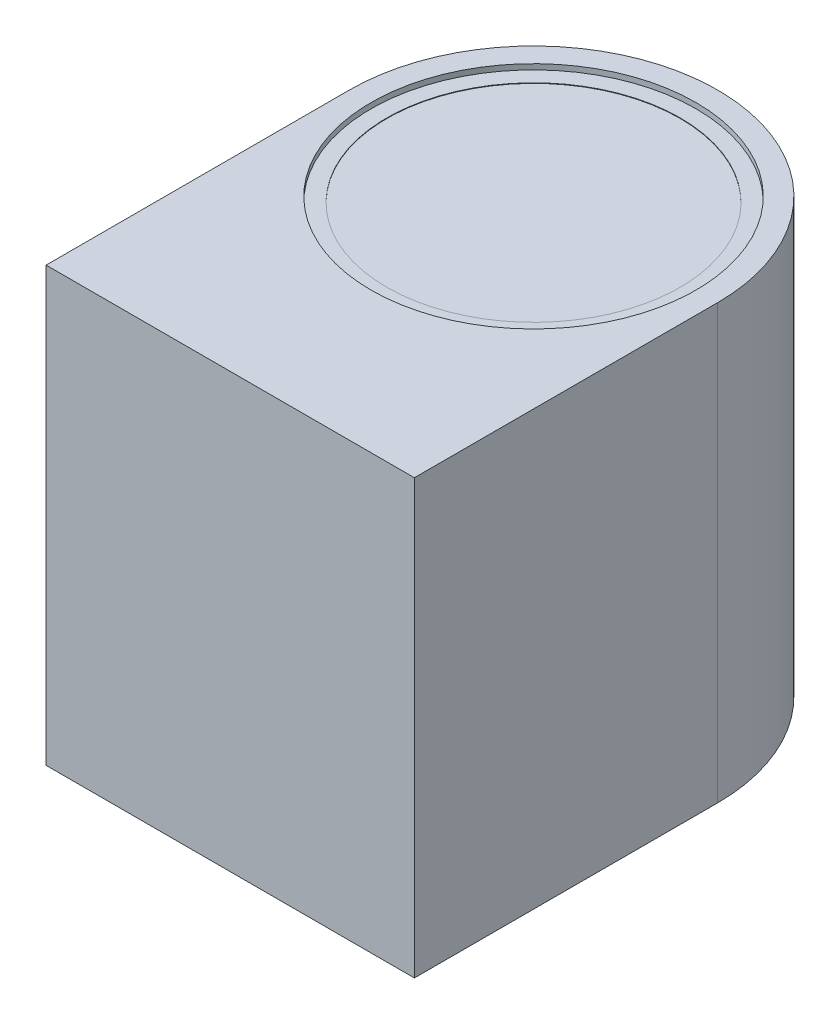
from build123d import *

# Parameters (mm, degrees)
SALIENTE_EXTRUIR1_DEPTH = 80
CROQUIS2_R              = 30
CORTAR_EXTRUIR1_DEPTH   = 1
CROQUIS3_R              = 27.091685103
CORTAR_EXTRUIR2_DEPTH   = 0.1


with BuildPart() as part:
    # Croquis1 → Saliente-Extruir1 (new body)
    with BuildSketch(Plane(origin=(0, 0, 0), x_dir=(1, 0, 0), z_dir=(0, 1, 0))):
        with BuildLine():
            Line((-34, 0), (-34, -56))
            Line((-34, -56), (34, -56))
            Line((34, -56), (34, 0))
            ThreePointArc((34, 0), (0, 34), (-34, 0))
        make_face()
    extrude(amount=SALIENTE_EXTRUIR1_DEPTH)

    # Croquis2 → Cortar-Extruir1 (cut)
    with BuildSketch(Plane(origin=(0, 80, 0), x_dir=(1, 0, 0), z_dir=(0, 1, 0))):
        with Locations(Location((0, 0, 0), (0, 0, 270))):
            Circle(CROQUIS2_R)
    extrude(amount=-CORTAR_EXTRUIR1_DEPTH, mode=Mode.SUBTRACT)

    # Croquis3 → Cortar-Extruir2 (cut)
    with BuildSketch(Plane(origin=(0, 79, 0), x_dir=(1, 0, 0), z_dir=(0, 1, 0))):
        with Locations(Location((0, 0, 0), (0, 0, 270))):
            Circle(CROQUIS3_R)
    extrude(amount=-CORTAR_EXTRUIR2_DEPTH, mode=Mode.SUBTRACT)


solid = part.part
